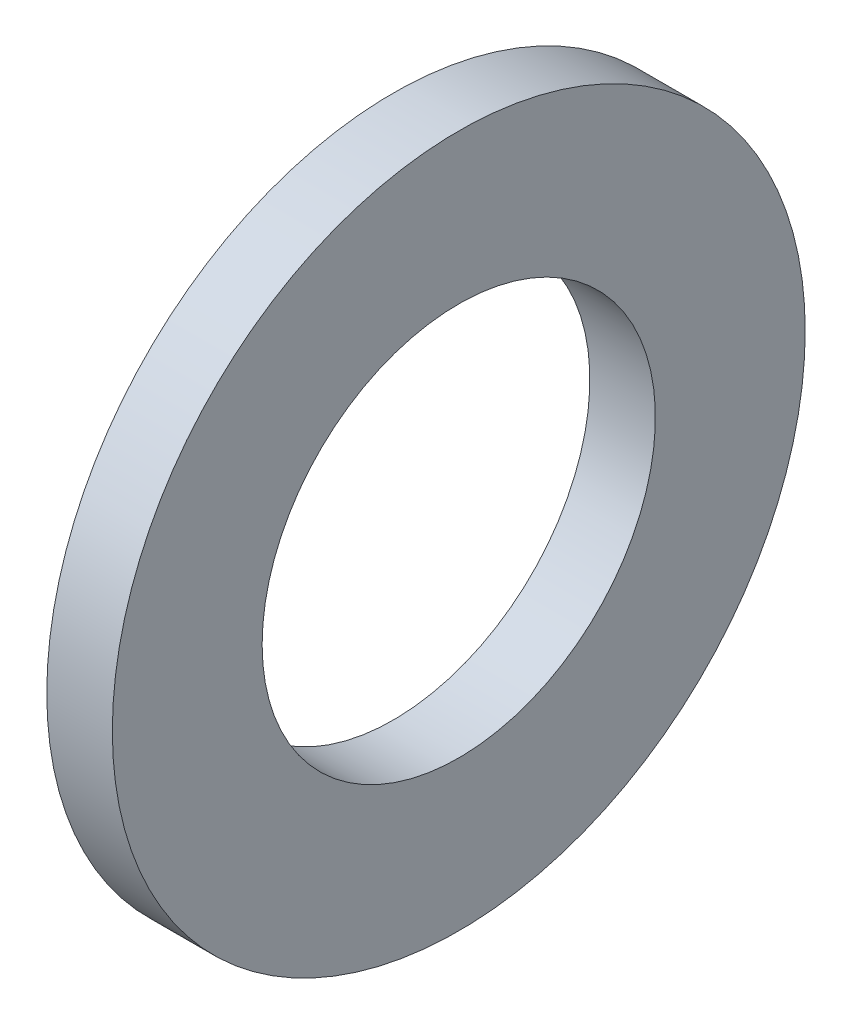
ISO-10303-21;
HEADER;
FILE_DESCRIPTION(('STEP AP214'),'2;1');
FILE_NAME('part.step','',(''),(''),'','','');
FILE_SCHEMA(('AUTOMOTIVE_DESIGN { 1 0 10303 214 1 1 1 1 }'));
ENDSEC;
DATA;
#1=APPLICATION_CONTEXT('core data for automotive mechanical design processes');
#2=APPLICATION_PROTOCOL_DEFINITION('international standard','automotive_design',2000,#1);
#3=PRODUCT_CONTEXT('',#1,'mechanical');
#4=PRODUCT('Part','Part','',(#3));
#5=PRODUCT_RELATED_PRODUCT_CATEGORY('part','',(#4));
#6=PRODUCT_DEFINITION_FORMATION('','',#4);
#7=PRODUCT_DEFINITION_CONTEXT('part definition',#1,'design');
#8=PRODUCT_DEFINITION('design','',#6,#7);
#9=PRODUCT_DEFINITION_SHAPE('','',#8);
#10=(LENGTH_UNIT() NAMED_UNIT(*) SI_UNIT(.MILLI.,.METRE.));
#11=(NAMED_UNIT(*) PLANE_ANGLE_UNIT() SI_UNIT($,.RADIAN.));
#12=(NAMED_UNIT(*) SI_UNIT($,.STERADIAN.) SOLID_ANGLE_UNIT());
#13=UNCERTAINTY_MEASURE_WITH_UNIT(LENGTH_MEASURE(1.E-05),#10,'distance_accuracy_value','');
#14=(GEOMETRIC_REPRESENTATION_CONTEXT(3) GLOBAL_UNCERTAINTY_ASSIGNED_CONTEXT((#13)) GLOBAL_UNIT_ASSIGNED_CONTEXT((#10,
#11,#12)) REPRESENTATION_CONTEXT('',''));
#15=CARTESIAN_POINT('',(0.,0.,0.));
#16=DIRECTION('',(0.,0.,1.));
#17=DIRECTION('',(1.,0.,0.));
#18=AXIS2_PLACEMENT_3D('',#15,#16,#17);
#19=CARTESIAN_POINT('',(-34.9249999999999,0.,0.));
#20=DIRECTION('',(-1.,0.,0.));
#21=DIRECTION('',(0.,0.,1.));
#22=AXIS2_PLACEMENT_3D('',#19,#20,#21);
#23=CYLINDRICAL_SURFACE('',#22,10.5);
#24=CARTESIAN_POINT('',(0.,0.,0.));
#25=DIRECTION('',(-1.,0.,0.));
#26=DIRECTION('',(0.,0.,1.));
#27=AXIS2_PLACEMENT_3D('',#24,#25,#26);
#28=CIRCLE('',#27,10.5);
#29=CARTESIAN_POINT('',(0.,0.,10.5));
#30=VERTEX_POINT('',#29);
#31=EDGE_CURVE('E10',#30,#30,#28,.T.);
#32=ORIENTED_EDGE('',*,*,#31,.F.);
#33=EDGE_LOOP('',(#32));
#34=FACE_BOUND('',#33,.T.);
#35=CARTESIAN_POINT('',(-3.5,0.,0.));
#36=DIRECTION('',(-1.,0.,0.));
#37=DIRECTION('',(0.,0.,1.));
#38=AXIS2_PLACEMENT_3D('',#35,#36,#37);
#39=CIRCLE('',#38,10.5);
#40=CARTESIAN_POINT('',(-3.5,0.,10.5));
#41=VERTEX_POINT('',#40);
#42=EDGE_CURVE('E44',#41,#41,#39,.T.);
#43=ORIENTED_EDGE('',*,*,#42,.T.);
#44=EDGE_LOOP('',(#43));
#45=FACE_BOUND('',#44,.T.);
#46=ADVANCED_FACE('F30',(#34,#45),#23,.F.);
#47=CARTESIAN_POINT('',(0.,10.5,0.));
#48=DIRECTION('',(-1.,0.,0.));
#49=DIRECTION('',(0.,0.,1.));
#50=AXIS2_PLACEMENT_3D('',#47,#48,#49);
#51=PLANE('',#50);
#52=CARTESIAN_POINT('',(0.,0.,0.));
#53=DIRECTION('',(-1.,0.,0.));
#54=DIRECTION('',(0.,0.,1.));
#55=AXIS2_PLACEMENT_3D('',#52,#53,#54);
#56=CIRCLE('',#55,18.5);
#57=CARTESIAN_POINT('',(0.,0.,18.5));
#58=VERTEX_POINT('',#57);
#59=EDGE_CURVE('E36',#58,#58,#56,.T.);
#60=ORIENTED_EDGE('',*,*,#59,.F.);
#61=EDGE_LOOP('',(#60));
#62=FACE_BOUND('',#61,.T.);
#63=ORIENTED_EDGE('',*,*,#31,.T.);
#64=EDGE_LOOP('',(#63));
#65=FACE_BOUND('',#64,.T.);
#66=ADVANCED_FACE('F59',(#62,#65),#51,.F.);
#67=CARTESIAN_POINT('',(-34.9249999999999,0.,0.));
#68=DIRECTION('',(-1.,0.,0.));
#69=DIRECTION('',(0.,0.,1.));
#70=AXIS2_PLACEMENT_3D('',#67,#68,#69);
#71=CYLINDRICAL_SURFACE('',#70,18.5);
#72=CARTESIAN_POINT('',(-3.5,0.,0.));
#73=DIRECTION('',(-1.,0.,0.));
#74=DIRECTION('',(0.,0.,1.));
#75=AXIS2_PLACEMENT_3D('',#72,#73,#74);
#76=CIRCLE('',#75,18.5);
#77=CARTESIAN_POINT('',(-3.5,0.,18.5));
#78=VERTEX_POINT('',#77);
#79=EDGE_CURVE('E40',#78,#78,#76,.T.);
#80=ORIENTED_EDGE('',*,*,#79,.F.);
#81=EDGE_LOOP('',(#80));
#82=FACE_BOUND('',#81,.T.);
#83=ORIENTED_EDGE('',*,*,#59,.T.);
#84=EDGE_LOOP('',(#83));
#85=FACE_BOUND('',#84,.T.);
#86=ADVANCED_FACE('F54',(#82,#85),#71,.T.);
#87=CARTESIAN_POINT('',(-3.5,18.5,0.));
#88=DIRECTION('',(1.,0.,0.));
#89=DIRECTION('',(0.,0.,-1.));
#90=AXIS2_PLACEMENT_3D('',#87,#88,#89);
#91=PLANE('',#90);
#92=ORIENTED_EDGE('',*,*,#42,.F.);
#93=EDGE_LOOP('',(#92));
#94=FACE_BOUND('',#93,.T.);
#95=ORIENTED_EDGE('',*,*,#79,.T.);
#96=EDGE_LOOP('',(#95));
#97=FACE_BOUND('',#96,.T.);
#98=ADVANCED_FACE('F51',(#94,#97),#91,.F.);
#99=CLOSED_SHELL('',(#46,#66,#86,#98));
#100=MANIFOLD_SOLID_BREP('B2',#99);
#101=ADVANCED_BREP_SHAPE_REPRESENTATION('',(#18,#100),#14);
#102=SHAPE_DEFINITION_REPRESENTATION(#9,#101);
ENDSEC;
END-ISO-10303-21;
